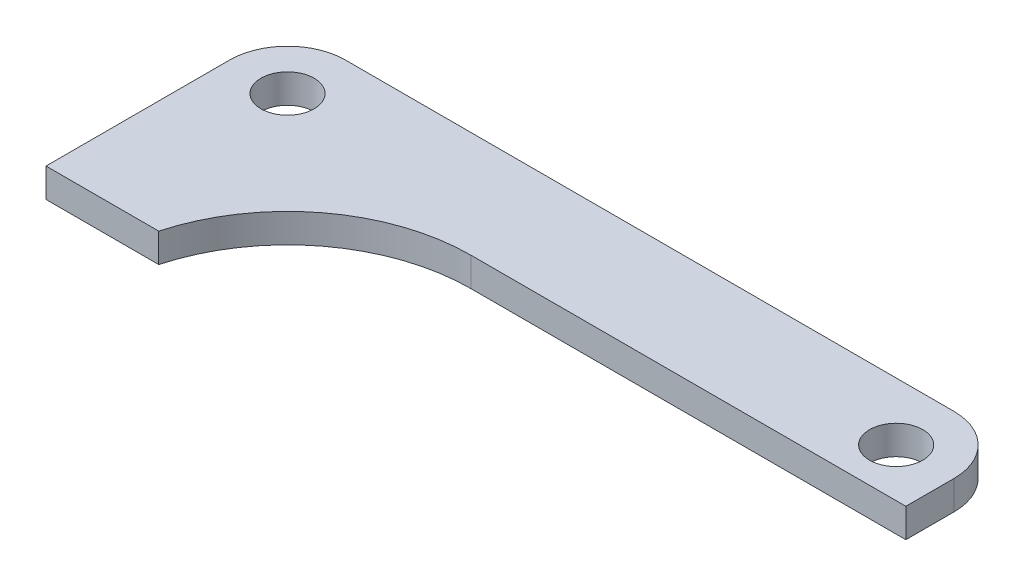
from build123d import *

# Parameters (mm, degrees)
SKETCH1_R      = 2.75
EXTRUDE1_DEPTH = 3


with BuildPart() as part:
    # Sketch1 → Extrude1 (new body)
    with BuildSketch(Plane(origin=(0, 0, 0), x_dir=(1, 0, 0), z_dir=(0, 1, 0))):
        with BuildLine():
            Line((30, 14), (75, 14))
            Line((75, 14), (75, 19))
            ThreePointArc((75, 19), (73.242640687, 23.242640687), (69, 25))
            Line((69, 25), (6, 25))
            ThreePointArc((6, 25), (1.757359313, 23.242640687), (0, 19))
            Line((0, 19), (0, 0))
            Line((0, 0), (11.66969722, 0))
            ThreePointArc((11.66969722, 0), (18.467437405, 10.099668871), (30, 14))
        make_face()
        with Locations(Location((6, 19, 0), (0, 0, 270))):
            Circle(SKETCH1_R, mode=Mode.SUBTRACT)
        with Locations(Location((69, 19, 0), (0, 0, 270))):
            Circle(SKETCH1_R, mode=Mode.SUBTRACT)
    extrude(amount=EXTRUDE1_DEPTH)


solid = part.part
